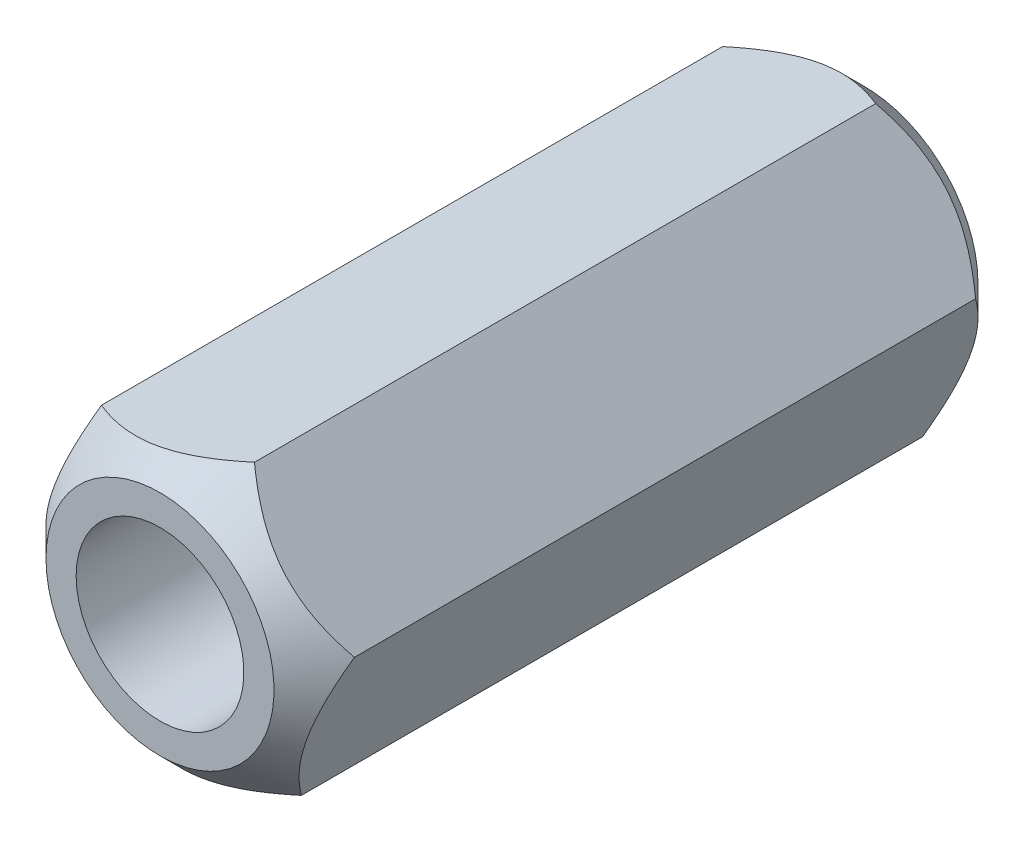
ISO-10303-21;
HEADER;
FILE_DESCRIPTION(('STEP AP214'),'2;1');
FILE_NAME('part.step','',(''),(''),'','','');
FILE_SCHEMA(('AUTOMOTIVE_DESIGN { 1 0 10303 214 1 1 1 1 }'));
ENDSEC;
DATA;
#1=APPLICATION_CONTEXT('core data for automotive mechanical design processes');
#2=APPLICATION_PROTOCOL_DEFINITION('international standard','automotive_design',2000,#1);
#3=PRODUCT_CONTEXT('',#1,'mechanical');
#4=PRODUCT('Part','Part','',(#3));
#5=PRODUCT_RELATED_PRODUCT_CATEGORY('part','',(#4));
#6=PRODUCT_DEFINITION_FORMATION('','',#4);
#7=PRODUCT_DEFINITION_CONTEXT('part definition',#1,'design');
#8=PRODUCT_DEFINITION('design','',#6,#7);
#9=PRODUCT_DEFINITION_SHAPE('','',#8);
#10=(LENGTH_UNIT() NAMED_UNIT(*) SI_UNIT(.MILLI.,.METRE.));
#11=(NAMED_UNIT(*) PLANE_ANGLE_UNIT() SI_UNIT($,.RADIAN.));
#12=(NAMED_UNIT(*) SI_UNIT($,.STERADIAN.) SOLID_ANGLE_UNIT());
#13=UNCERTAINTY_MEASURE_WITH_UNIT(LENGTH_MEASURE(1.E-05),#10,'distance_accuracy_value','');
#14=(GEOMETRIC_REPRESENTATION_CONTEXT(3) GLOBAL_UNCERTAINTY_ASSIGNED_CONTEXT((#13)) GLOBAL_UNIT_ASSIGNED_CONTEXT((#10,
#11,#12)) REPRESENTATION_CONTEXT('',''));
#15=CARTESIAN_POINT('',(0.,0.,0.));
#16=DIRECTION('',(0.,0.,1.));
#17=DIRECTION('',(1.,0.,0.));
#18=AXIS2_PLACEMENT_3D('',#15,#16,#17);
#19=CARTESIAN_POINT('',(23.598367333,209.806088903,-17.));
#20=DIRECTION('',(0.,0.,-1.));
#21=DIRECTION('',(-0.984657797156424,-0.174496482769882,0.));
#22=AXIS2_PLACEMENT_3D('',#19,#20,#21);
#23=PLANE('',#22);
#24=CARTESIAN_POINT('',(17.14,214.32,-17.));
#25=DIRECTION('',(0.,0.,-1.));
#26=DIRECTION('',(-1.,0.,0.));
#27=AXIS2_PLACEMENT_3D('',#24,#25,#26);
#28=CIRCLE('',#27,4.04999999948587);
#29=CARTESIAN_POINT('',(13.0900000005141,214.32,-17.));
#30=VERTEX_POINT('',#29);
#31=EDGE_CURVE('E205',#30,#30,#28,.T.);
#32=ORIENTED_EDGE('',*,*,#31,.F.);
#33=EDGE_LOOP('',(#32));
#34=FACE_BOUND('',#33,.T.);
#35=CARTESIAN_POINT('',(17.14,214.32,-16.9999999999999));
#36=DIRECTION('',(0.,0.,1.));
#37=DIRECTION('',(1.,0.,0.));
#38=AXIS2_PLACEMENT_3D('',#35,#36,#37);
#39=CIRCLE('',#38,5.50555349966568);
#40=CARTESIAN_POINT('',(22.6455534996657,214.32,-16.9999999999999));
#41=VERTEX_POINT('',#40);
#42=EDGE_CURVE('E16',#41,#41,#39,.F.);
#43=ORIENTED_EDGE('',*,*,#42,.T.);
#44=EDGE_LOOP('',(#43));
#45=FACE_BOUND('',#44,.T.);
#46=ADVANCED_FACE('F12',(#34,#45),#23,.T.);
#47=CARTESIAN_POINT('',(17.14,214.32,-17.));
#48=DIRECTION('',(0.,0.,1.));
#49=DIRECTION('',(1.,0.,0.));
#50=AXIS2_PLACEMENT_3D('',#47,#48,#49);
#51=CONICAL_SURFACE('',#50,5.50555349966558,0.785398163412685);
#52=CARTESIAN_POINT('',(19.7009737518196,221.375122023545,-15.0000000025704));
#53=CARTESIAN_POINT('',(19.7840077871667,221.276338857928,-15.0645131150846));
#54=CARTESIAN_POINT('',(19.8676800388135,221.176796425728,-15.1270462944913));
#55=CARTESIAN_POINT('',(20.0364261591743,220.976044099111,-15.2475505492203));
#56=CARTESIAN_POINT('',(20.1215007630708,220.87483333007,-15.3055191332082));
#57=CARTESIAN_POINT('',(20.3798060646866,220.567535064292,-15.4721688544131));
#58=CARTESIAN_POINT('',(20.5552232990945,220.358846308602,-15.5728831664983));
#59=CARTESIAN_POINT('',(20.9089660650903,219.938008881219,-15.7453489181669));
#60=CARTESIAN_POINT('',(21.0872012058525,219.725967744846,-15.8175348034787));
#61=CARTESIAN_POINT('',(21.3574838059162,219.404420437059,-15.9010357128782));
#62=CARTESIAN_POINT('',(21.4479758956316,219.296764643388,-15.9247285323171));
#63=CARTESIAN_POINT('',(21.6297261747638,219.080541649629,-15.9633187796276));
#64=CARTESIAN_POINT('',(21.7209842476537,218.971974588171,-15.9782175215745));
#65=CARTESIAN_POINT('',(21.943375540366,218.707402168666,-16.0031980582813));
#66=CARTESIAN_POINT('',(22.0747483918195,218.551111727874,-16.008438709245));
#67=CARTESIAN_POINT('',(22.3372572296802,218.23881263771,-15.9996376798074));
#68=CARTESIAN_POINT('',(22.4683931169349,218.082804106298,-15.9855892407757));
#69=CARTESIAN_POINT('',(22.729428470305,217.772257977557,-15.9390381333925));
#70=CARTESIAN_POINT('',(22.85932638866,217.617722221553,-15.9065148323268));
#71=CARTESIAN_POINT('',(23.116889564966,217.311306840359,-15.8247821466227));
#72=CARTESIAN_POINT('',(23.2445549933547,217.159427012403,-15.7755740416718));
#73=CARTESIAN_POINT('',(23.4711684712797,216.889831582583,-15.6743452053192));
#74=CARTESIAN_POINT('',(23.5706186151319,216.771518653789,-15.6249882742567));
#75=CARTESIAN_POINT('',(23.7677339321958,216.537016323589,-15.5183218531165));
#76=CARTESIAN_POINT('',(23.8653990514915,216.420826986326,-15.4610121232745));
#77=CARTESIAN_POINT('',(24.0586366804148,216.190937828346,-15.339724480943));
#78=CARTESIAN_POINT('',(24.1542146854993,216.077231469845,-15.275767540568));
#79=CARTESIAN_POINT('',(24.3436011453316,215.851923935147,-15.1420248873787));
#80=CARTESIAN_POINT('',(24.4374106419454,215.740321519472,-15.0722427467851));
#81=CARTESIAN_POINT('',(24.5304017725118,215.62969268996,-15.0000000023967));
#82=B_SPLINE_CURVE_WITH_KNOTS('',3,(#52,#53,#54,#55,#56,#57,#58,#59,#60,#61,#62,#63,#64,#65,#66,
#67,#68,#69,#70,#71,#72,#73,#74,#75,#76,#77,#78,#79,#80,#81),.UNSPECIFIED.,.F.,.F.,(4,2,2,2,2,2,
2,2,2,2,2,2,2,2,4),(0.,0.432793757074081,0.86582211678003,1.73655298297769,2.59345958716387,
3.02107268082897,3.44862186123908,4.0603826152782,4.67235777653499,5.28501773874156,
5.89763072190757,6.38414619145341,6.87067633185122,7.35571555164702,7.84045948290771),.UNSPECIFIED.);
#83=CARTESIAN_POINT('',(19.7009737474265,221.375122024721,-15.0000000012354));
#84=VERTEX_POINT('',#83);
#85=CARTESIAN_POINT('',(24.5304017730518,215.629692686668,-15.0000000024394));
#86=VERTEX_POINT('',#85);
#87=EDGE_CURVE('E58',#84,#86,#82,.T.);
#88=ORIENTED_EDGE('',*,*,#87,.T.);
#89=CARTESIAN_POINT('',(24.5304017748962,215.629692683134,-15.0000000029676));
#90=CARTESIAN_POINT('',(24.4863700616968,215.508391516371,-15.0645131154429));
#91=CARTESIAN_POINT('',(24.4419999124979,215.386158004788,-15.1270462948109));
#92=CARTESIAN_POINT('',(24.3525163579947,215.139643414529,-15.2475505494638));
#93=CARTESIAN_POINT('',(24.3074025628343,215.015361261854,-15.3055191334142));
#94=CARTESIAN_POINT('',(24.1704271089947,214.638013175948,-15.4721688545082));
#95=CARTESIAN_POINT('',(24.0774059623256,214.381753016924,-15.5728831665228));
#96=CARTESIAN_POINT('',(23.8898214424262,213.864984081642,-15.7453489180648));
#97=CARTESIAN_POINT('',(23.7953060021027,213.604607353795,-15.8175348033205));
#98=CARTESIAN_POINT('',(23.6519791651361,213.209762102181,-15.9010357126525));
#99=CARTESIAN_POINT('',(23.6039925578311,213.077565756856,-15.9247285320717));
#100=CARTESIAN_POINT('',(23.5076130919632,212.812053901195,-15.9633187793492));
#101=CARTESIAN_POINT('',(23.4592202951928,212.67873856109,-15.9782175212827));
#102=CARTESIAN_POINT('',(23.341289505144,212.353855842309,-16.0031980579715));
#103=CARTESIAN_POINT('',(23.2716244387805,212.16193839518,-16.0084387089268));
#104=CARTESIAN_POINT('',(23.1324199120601,211.77844952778,-15.9996376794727));
#105=CARTESIAN_POINT('',(23.0628805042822,211.586878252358,-15.9855892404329));
#106=CARTESIAN_POINT('',(22.9244573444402,211.20554194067,-15.9390381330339));
#107=CARTESIAN_POINT('',(22.8555744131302,211.015779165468,-15.9065148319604));
#108=CARTESIAN_POINT('',(22.7189924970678,210.639515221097,-15.8247821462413));
#109=CARTESIAN_POINT('',(22.6512934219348,210.453013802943,-15.7755740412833));
#110=CARTESIAN_POINT('',(22.5311236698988,210.121963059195,-15.6743452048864));
#111=CARTESIAN_POINT('',(22.4783867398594,209.976680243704,-15.6249882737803));
#112=CARTESIAN_POINT('',(22.3738594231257,209.68872220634,-15.5183218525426));
#113=CARTESIAN_POINT('',(22.3220690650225,209.546047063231,-15.4610121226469));
#114=CARTESIAN_POINT('',(22.2195980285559,209.263753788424,-15.3397244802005));
#115=CARTESIAN_POINT('',(22.1689144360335,209.124127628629,-15.2757675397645));
#116=CARTESIAN_POINT('',(22.0684856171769,208.847460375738,-15.1420248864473));
#117=CARTESIAN_POINT('',(22.0187398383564,208.710417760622,-15.0722427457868));
#118=CARTESIAN_POINT('',(21.9694280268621,208.574570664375,-15.0000000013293));
#119=B_SPLINE_CURVE_WITH_KNOTS('',3,(#89,#90,#91,#92,#93,#94,#95,#96,#97,#98,#99,#100,#101,#102,
#103,#104,#105,#106,#107,#108,#109,#110,#111,#112,#113,#114,#115,#116,#117,#118),.UNSPECIFIED.,
.F.,.F.,(4,2,2,2,2,2,2,2,2,2,2,2,2,2,4),(0.,0.432793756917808,0.865822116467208,
1.73655298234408,2.59345958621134,3.02107267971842,3.44862185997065,4.06038261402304,
4.67235777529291,5.28501773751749,5.89763072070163,6.38414619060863,6.87067633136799,
7.35571555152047,7.84045948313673),.UNSPECIFIED.);
#120=CARTESIAN_POINT('',(21.9694280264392,208.57457066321,-15.0000000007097));
#121=VERTEX_POINT('',#120);
#122=EDGE_CURVE('E61',#86,#121,#119,.T.);
#123=ORIENTED_EDGE('',*,*,#122,.T.);
#124=CARTESIAN_POINT('',(21.9694280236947,208.574570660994,-15.0000000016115));
#125=CARTESIAN_POINT('',(21.8423622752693,208.552052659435,-15.064513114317));
#126=CARTESIAN_POINT('',(21.7143198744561,208.529361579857,-15.1270462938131));
#127=CARTESIAN_POINT('',(21.4560901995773,208.483599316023,-15.2475505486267));
#128=CARTESIAN_POINT('',(21.3259018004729,208.460527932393,-15.3055191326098));
#129=CARTESIAN_POINT('',(20.9306210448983,208.390478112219,-15.4721688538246));
#130=CARTESIAN_POINT('',(20.6621826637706,208.342906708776,-15.5728831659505));
#131=CARTESIAN_POINT('',(20.1208553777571,208.246975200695,-15.7453489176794));
#132=CARTESIAN_POINT('',(19.8481047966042,208.198639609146,-15.8175348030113));
#133=CARTESIAN_POINT('',(19.4344953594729,208.125341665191,-15.9010357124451));
#134=CARTESIAN_POINT('',(19.2960166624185,208.100801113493,-15.924728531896));
#135=CARTESIAN_POINT('',(19.0178869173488,208.051512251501,-15.9633187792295));
#136=CARTESIAN_POINT('',(18.8782360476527,208.026763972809,-15.9782175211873));
#137=CARTESIAN_POINT('',(18.5379139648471,207.966453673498,-16.0031980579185));
#138=CARTESIAN_POINT('',(18.336876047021,207.930826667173,-16.0084387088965));
#139=CARTESIAN_POINT('',(17.9351626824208,207.859636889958,-15.9996376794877));
#140=CARTESIAN_POINT('',(17.7344873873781,207.824074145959,-15.9855892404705));
#141=CARTESIAN_POINT('',(17.3350288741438,207.753283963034,-15.9390381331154));
#142=CARTESIAN_POINT('',(17.1362480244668,207.718056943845,-15.9065148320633));
#143=CARTESIAN_POINT('',(16.7421029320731,207.64820838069,-15.8247821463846));
#144=CARTESIAN_POINT('',(16.5467384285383,207.613586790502,-15.7755740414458));
#145=CARTESIAN_POINT('',(16.1999551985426,207.552131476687,-15.6743452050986));
#146=CARTESIAN_POINT('',(16.0477681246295,207.525161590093,-15.6249882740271));
#147=CARTESIAN_POINT('',(15.7461254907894,207.471705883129,-15.518321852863));
#148=CARTESIAN_POINT('',(15.5966700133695,207.445220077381,-15.4610121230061));
#149=CARTESIAN_POINT('',(15.3009613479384,207.392815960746,-15.3397244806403));
#150=CARTESIAN_POINT('',(15.1546997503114,207.366896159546,-15.275767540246));
#151=CARTESIAN_POINT('',(14.8648844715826,207.315536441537,-15.1420248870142));
#152=CARTESIAN_POINT('',(14.7213291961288,207.290096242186,-15.0722427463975));
#153=CARTESIAN_POINT('',(14.5790262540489,207.26487797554,-15.0000000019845));
#154=B_SPLINE_CURVE_WITH_KNOTS('',3,(#124,#125,#126,#127,#128,#129,#130,#131,#132,#133,#134,
#135,#136,#137,#138,#139,#140,#141,#142,#143,#144,#145,#146,#147,#148,#149,#150,#151,#152,#153),
.UNSPECIFIED.,.F.,.F.,(4,2,2,2,2,2,2,2,2,2,2,2,2,2,4),(0.,0.432793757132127,0.865822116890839,
1.73655298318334,2.59345958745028,3.02107268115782,3.4486218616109,4.06038261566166,
4.67235777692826,5.28501773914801,5.89763072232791,6.38414619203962,6.87067633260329,
7.35571555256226,7.84045948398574),.UNSPECIFIED.);
#155=CARTESIAN_POINT('',(14.5790262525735,207.264877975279,-15.0000000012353));
#156=VERTEX_POINT('',#155);
#157=EDGE_CURVE('E138',#121,#156,#154,.T.);
#158=ORIENTED_EDGE('',*,*,#157,.T.);
#159=CARTESIAN_POINT('',(14.5790262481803,207.264877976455,-15.0000000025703));
#160=CARTESIAN_POINT('',(14.4959922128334,207.363661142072,-15.0645131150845));
#161=CARTESIAN_POINT('',(14.4123199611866,207.463203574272,-15.1270462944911));
#162=CARTESIAN_POINT('',(14.2435738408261,207.663955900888,-15.2475505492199));
#163=CARTESIAN_POINT('',(14.1584992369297,207.76516666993,-15.3055191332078));
#164=CARTESIAN_POINT('',(13.9001939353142,208.072464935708,-15.4721688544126));
#165=CARTESIAN_POINT('',(13.7247767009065,208.281153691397,-15.5728831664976));
#166=CARTESIAN_POINT('',(13.3710339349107,208.70199111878,-15.7453489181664));
#167=CARTESIAN_POINT('',(13.1927987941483,208.914032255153,-15.8175348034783));
#168=CARTESIAN_POINT('',(12.9225161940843,209.23557956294,-15.9010357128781));
#169=CARTESIAN_POINT('',(12.8320241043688,209.343235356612,-15.924728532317));
#170=CARTESIAN_POINT('',(12.6502738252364,209.559458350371,-15.9633187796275));
#171=CARTESIAN_POINT('',(12.5590157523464,209.668025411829,-15.9782175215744));
#172=CARTESIAN_POINT('',(12.3366244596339,209.932597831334,-16.0031980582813));
#173=CARTESIAN_POINT('',(12.2052516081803,210.088888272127,-16.0084387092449));
#174=CARTESIAN_POINT('',(11.9427427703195,210.40118736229,-15.9996376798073));
#175=CARTESIAN_POINT('',(11.8116068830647,210.557195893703,-15.9855892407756));
#176=CARTESIAN_POINT('',(11.5505715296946,210.867742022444,-15.9390381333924));
#177=CARTESIAN_POINT('',(11.4206736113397,211.022277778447,-15.9065148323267));
#178=CARTESIAN_POINT('',(11.1631104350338,211.328693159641,-15.8247821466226));
#179=CARTESIAN_POINT('',(11.0354450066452,211.480572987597,-15.7755740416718));
#180=CARTESIAN_POINT('',(10.8088315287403,211.750168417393,-15.674345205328));
#181=CARTESIAN_POINT('',(10.7093813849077,211.868481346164,-15.6249882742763));
#182=CARTESIAN_POINT('',(10.5122660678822,212.102983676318,-15.5183218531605));
#183=CARTESIAN_POINT('',(10.4146009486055,212.219173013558,-15.4610121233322));
#184=CARTESIAN_POINT('',(10.2213633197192,212.449062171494,-15.3397244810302));
#185=CARTESIAN_POINT('',(10.1257853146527,212.562768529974,-15.2757675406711));
#186=CARTESIAN_POINT('',(9.93639885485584,212.78807606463,-15.1420248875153));
#187=CARTESIAN_POINT('',(9.84258935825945,212.899678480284,-15.0722427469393));
#188=CARTESIAN_POINT('',(9.74959822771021,213.010307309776,-15.0000000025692));
#189=B_SPLINE_CURVE_WITH_KNOTS('',3,(#159,#160,#161,#162,#163,#164,#165,#166,#167,#168,#169,
#170,#171,#172,#173,#174,#175,#176,#177,#178,#179,#180,#181,#182,#183,#184,#185,#186,#187,#188),
.UNSPECIFIED.,.F.,.F.,(4,2,2,2,2,2,2,2,2,2,2,2,2,2,4),(0.,0.432793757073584,0.86582211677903,
1.73655298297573,2.59345958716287,3.02107268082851,3.44862186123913,4.06038261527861,
4.67235777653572,5.28501773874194,5.89763072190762,6.3841461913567,6.87067633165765,
7.35571555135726,7.84045948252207),.UNSPECIFIED.);
#190=CARTESIAN_POINT('',(9.74959822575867,213.010307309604,-15.0000000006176));
#191=VERTEX_POINT('',#190);
#192=EDGE_CURVE('E144',#156,#191,#189,.T.);
#193=ORIENTED_EDGE('',*,*,#192,.T.);
#194=CARTESIAN_POINT('',(9.74959822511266,213.010307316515,-15.0000000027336));
#195=CARTESIAN_POINT('',(9.79362993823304,213.131608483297,-15.0645131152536));
#196=CARTESIAN_POINT('',(9.83800008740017,213.253841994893,-15.1270462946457));
#197=CARTESIAN_POINT('',(9.92748364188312,213.500356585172,-15.2475505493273));
#198=CARTESIAN_POINT('',(9.97259743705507,213.624638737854,-15.3055191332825));
#199=CARTESIAN_POINT('',(10.1095728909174,214.001986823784,-15.4721688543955));
#200=CARTESIAN_POINT('',(10.2025940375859,214.258246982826,-15.5728831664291));
#201=CARTESIAN_POINT('',(10.390178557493,214.775015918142,-15.7453489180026));
#202=CARTESIAN_POINT('',(10.4846939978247,215.035392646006,-15.8175348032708));
#203=CARTESIAN_POINT('',(10.6280208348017,215.430237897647,-15.90103571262));
#204=CARTESIAN_POINT('',(10.6760074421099,215.562434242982,-15.9247285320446));
#205=CARTESIAN_POINT('',(10.7723869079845,215.827946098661,-15.9633187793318));
#206=CARTESIAN_POINT('',(10.8207797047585,215.961261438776,-15.9782175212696));
#207=CARTESIAN_POINT('',(10.9387104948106,216.286144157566,-16.003198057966));
#208=CARTESIAN_POINT('',(11.0083755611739,216.478061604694,-16.0084387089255));
#209=CARTESIAN_POINT('',(11.1475800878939,216.861550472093,-15.9996376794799));
#210=CARTESIAN_POINT('',(11.2171194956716,217.053121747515,-15.9855892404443));
#211=CARTESIAN_POINT('',(11.3555426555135,217.434458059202,-15.9390381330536));
#212=CARTESIAN_POINT('',(11.4244255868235,217.624220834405,-15.9065148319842));
#213=CARTESIAN_POINT('',(11.5610075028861,218.000484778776,-15.8247821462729));
#214=CARTESIAN_POINT('',(11.6287065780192,218.18698619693,-15.7755740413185));
#215=CARTESIAN_POINT('',(11.7488763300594,218.51803694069,-15.6743452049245));
#216=CARTESIAN_POINT('',(11.8016132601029,218.663319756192,-15.6249882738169));
#217=CARTESIAN_POINT('',(11.9061405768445,218.951277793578,-15.518321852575));
#218=CARTESIAN_POINT('',(11.9579309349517,219.093952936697,-15.4610121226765));
#219=CARTESIAN_POINT('',(12.0604019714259,219.376246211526,-15.3397244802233));
#220=CARTESIAN_POINT('',(12.111085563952,219.515872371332,-15.2757675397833));
#221=CARTESIAN_POINT('',(12.211514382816,219.792539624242,-15.1420248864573));
#222=CARTESIAN_POINT('',(12.2612601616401,219.929582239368,-15.0722427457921));
#223=CARTESIAN_POINT('',(12.3105719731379,220.065429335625,-15.0000000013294));
#224=B_SPLINE_CURVE_WITH_KNOTS('',3,(#194,#195,#196,#197,#198,#199,#200,#201,#202,#203,#204,
#205,#206,#207,#208,#209,#210,#211,#212,#213,#214,#215,#216,#217,#218,#219,#220,#221,#222,#223),
.UNSPECIFIED.,.F.,.F.,(4,2,2,2,2,2,2,2,2,2,2,2,2,2,4),(0.,0.432793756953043,0.865822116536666,
1.73655298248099,2.59345958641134,3.02107267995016,3.44862186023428,4.06038261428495,
4.67235777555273,5.28501773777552,5.89763072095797,6.38414619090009,6.87067633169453,
7.35571555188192,7.84045948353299),.UNSPECIFIED.);
#225=CARTESIAN_POINT('',(12.3105719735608,220.06542933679,-15.0000000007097));
#226=VERTEX_POINT('',#225);
#227=EDGE_CURVE('E157',#191,#226,#224,.T.);
#228=ORIENTED_EDGE('',*,*,#227,.T.);
#229=CARTESIAN_POINT('',(12.3105719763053,220.065429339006,-15.0000000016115));
#230=CARTESIAN_POINT('',(12.4376377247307,220.087947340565,-15.0645131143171));
#231=CARTESIAN_POINT('',(12.5656801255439,220.110638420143,-15.1270462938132));
#232=CARTESIAN_POINT('',(12.8239098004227,220.156400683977,-15.2475505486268));
#233=CARTESIAN_POINT('',(12.954098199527,220.179472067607,-15.3055191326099));
#234=CARTESIAN_POINT('',(13.3493789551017,220.249521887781,-15.4721688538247));
#235=CARTESIAN_POINT('',(13.6178173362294,220.297093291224,-15.5728831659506));
#236=CARTESIAN_POINT('',(14.1591446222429,220.393024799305,-15.7453489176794));
#237=CARTESIAN_POINT('',(14.4318952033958,220.441360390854,-15.8175348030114));
#238=CARTESIAN_POINT('',(14.8455046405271,220.514658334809,-15.9010357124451));
#239=CARTESIAN_POINT('',(14.9839833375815,220.539198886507,-15.9247285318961));
#240=CARTESIAN_POINT('',(15.2621130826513,220.588487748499,-15.9633187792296));
#241=CARTESIAN_POINT('',(15.4017639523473,220.613236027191,-15.9782175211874));
#242=CARTESIAN_POINT('',(15.742086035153,220.673546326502,-16.0031980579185));
#243=CARTESIAN_POINT('',(15.943123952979,220.709173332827,-16.0084387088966));
#244=CARTESIAN_POINT('',(16.3448373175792,220.780363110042,-15.9996376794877));
#245=CARTESIAN_POINT('',(16.5455126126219,220.815925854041,-15.9855892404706));
#246=CARTESIAN_POINT('',(16.9449711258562,220.886716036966,-15.9390381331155));
#247=CARTESIAN_POINT('',(17.1437519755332,220.921943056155,-15.9065148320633));
#248=CARTESIAN_POINT('',(17.5378970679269,220.99179161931,-15.8247821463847));
#249=CARTESIAN_POINT('',(17.7332615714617,221.026413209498,-15.7755740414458));
#250=CARTESIAN_POINT('',(18.0800448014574,221.087868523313,-15.6743452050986));
#251=CARTESIAN_POINT('',(18.2322318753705,221.114838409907,-15.6249882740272));
#252=CARTESIAN_POINT('',(18.5338745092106,221.168294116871,-15.518321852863));
#253=CARTESIAN_POINT('',(18.6833299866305,221.194779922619,-15.4610121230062));
#254=CARTESIAN_POINT('',(18.9790386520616,221.247184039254,-15.3397244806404));
#255=CARTESIAN_POINT('',(19.1253002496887,221.273103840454,-15.275767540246));
#256=CARTESIAN_POINT('',(19.4151155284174,221.324463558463,-15.1420248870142));
#257=CARTESIAN_POINT('',(19.5586708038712,221.349903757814,-15.0722427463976));
#258=CARTESIAN_POINT('',(19.7009737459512,221.37512202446,-15.0000000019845));
#259=B_SPLINE_CURVE_WITH_KNOTS('',3,(#229,#230,#231,#232,#233,#234,#235,#236,#237,#238,#239,
#240,#241,#242,#243,#244,#245,#246,#247,#248,#249,#250,#251,#252,#253,#254,#255,#256,#257,#258),
.UNSPECIFIED.,.F.,.F.,(4,2,2,2,2,2,2,2,2,2,2,2,2,2,4),(0.,0.432793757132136,0.86582211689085,
1.73655298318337,2.59345958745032,3.02107268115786,3.44862186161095,4.0603826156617,
4.67235777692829,5.28501773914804,5.89763072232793,6.38414619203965,6.87067633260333,
7.35571555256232,7.84045948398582),.UNSPECIFIED.);
#260=EDGE_CURVE('E64',#226,#84,#259,.T.);
#261=ORIENTED_EDGE('',*,*,#260,.T.);
#262=EDGE_LOOP('',(#88,#123,#158,#193,#228,#261));
#263=FACE_BOUND('',#262,.T.);
#264=ORIENTED_EDGE('',*,*,#42,.F.);
#265=EDGE_LOOP('',(#264));
#266=FACE_BOUND('',#265,.T.);
#267=ADVANCED_FACE('F59',(#263,#266),#51,.T.);
#268=CARTESIAN_POINT('',(24.530401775,215.629692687,-16.239643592));
#269=DIRECTION('',(-0.939986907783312,0.341210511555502,0.));
#270=DIRECTION('',(-0.341210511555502,-0.939986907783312,0.));
#271=AXIS2_PLACEMENT_3D('',#268,#269,#270);
#272=PLANE('',#271);
#273=DIRECTION('',(0.,0.,-1.));
#274=VECTOR('',#273,1.);
#275=CARTESIAN_POINT('',(21.969428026,208.574570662,0.));
#276=LINE('',#275,#274);
#277=CARTESIAN_POINT('',(21.9694280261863,208.574570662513,15.000000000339));
#278=VERTEX_POINT('',#277);
#279=EDGE_CURVE('E72',#278,#121,#276,.T.);
#280=ORIENTED_EDGE('',*,*,#279,.T.);
#281=ORIENTED_EDGE('',*,*,#122,.F.);
#282=DIRECTION('',(0.,0.,1.));
#283=VECTOR('',#282,1.);
#284=CARTESIAN_POINT('',(24.530401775,215.629692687,0.));
#285=LINE('',#284,#283);
#286=CARTESIAN_POINT('',(24.5304017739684,215.629692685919,15.0000000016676));
#287=VERTEX_POINT('',#286);
#288=EDGE_CURVE('E31',#86,#287,#285,.T.);
#289=ORIENTED_EDGE('',*,*,#288,.T.);
#290=CARTESIAN_POINT('',(24.5304017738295,215.629692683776,15.0000000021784));
#291=CARTESIAN_POINT('',(24.4863700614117,215.508391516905,15.0645131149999));
#292=CARTESIAN_POINT('',(24.4419999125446,215.386158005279,15.1270462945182));
#293=CARTESIAN_POINT('',(24.352516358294,215.139643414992,15.2475505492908));
#294=CARTESIAN_POINT('',(24.3074025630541,215.015361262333,15.3055191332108));
#295=CARTESIAN_POINT('',(24.1704271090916,214.638013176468,15.4721688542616));
#296=CARTESIAN_POINT('',(24.077405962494,214.381753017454,15.5728831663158));
#297=CARTESIAN_POINT('',(23.8898214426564,213.864984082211,15.7453489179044));
#298=CARTESIAN_POINT('',(23.7953060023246,213.604607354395,15.8175348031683));
#299=CARTESIAN_POINT('',(23.6519791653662,213.209762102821,15.9010357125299));
#300=CARTESIAN_POINT('',(23.603992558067,213.077565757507,15.9247285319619));
#301=CARTESIAN_POINT('',(23.5076130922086,212.81205390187,15.9633187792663));
#302=CARTESIAN_POINT('',(23.4592202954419,212.678738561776,15.978217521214));
#303=CARTESIAN_POINT('',(23.3412895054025,212.353855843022,16.0031980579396));
#304=CARTESIAN_POINT('',(23.2716244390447,212.161938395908,16.0084387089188));
#305=CARTESIAN_POINT('',(23.1324199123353,211.778449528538,15.9996376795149));
#306=CARTESIAN_POINT('',(23.0628805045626,211.58687825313,15.9855892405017));
#307=CARTESIAN_POINT('',(22.9244573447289,211.205541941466,15.9390381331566));
#308=CARTESIAN_POINT('',(22.8555744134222,211.015779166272,15.9065148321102));
#309=CARTESIAN_POINT('',(22.7189924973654,210.639515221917,15.8247821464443));
#310=CARTESIAN_POINT('',(22.6512934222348,210.45301380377,15.7755740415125));
#311=CARTESIAN_POINT('',(22.5311236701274,210.121963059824,15.6743452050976));
#312=CARTESIAN_POINT('',(22.4783867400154,209.976680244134,15.6249882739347));
#313=CARTESIAN_POINT('',(22.3738594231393,209.688722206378,15.5183218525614));
#314=CARTESIAN_POINT('',(22.3220690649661,209.546047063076,15.4610121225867));
#315=CARTESIAN_POINT('',(22.2195980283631,209.263753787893,15.3397244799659));
#316=CARTESIAN_POINT('',(22.1689144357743,209.124127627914,15.2757675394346));
#317=CARTESIAN_POINT('',(22.0684856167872,208.847460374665,15.1420248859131));
#318=CARTESIAN_POINT('',(22.0187398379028,208.710417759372,15.0722427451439));
#319=CARTESIAN_POINT('',(21.9694280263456,208.574570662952,15.0000000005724));
#320=B_SPLINE_CURVE_WITH_KNOTS('',3,(#290,#291,#292,#293,#294,#295,#296,#297,#298,#299,#300,
#301,#302,#303,#304,#305,#306,#307,#308,#309,#310,#311,#312,#313,#314,#315,#316,#317,#318,#319),
.UNSPECIFIED.,.F.,.F.,(4,2,2,2,2,2,2,2,2,2,2,2,2,2,4),(0.,0.432793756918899,0.865822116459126,
1.73655298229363,2.59345958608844,3.0210726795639,3.44862185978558,4.06038261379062,
4.67235777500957,5.2850177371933,5.89763072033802,6.38414619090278,6.87067633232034,
7.35571555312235,7.84045948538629),.UNSPECIFIED.);
#321=EDGE_CURVE('E77',#287,#278,#320,.T.);
#322=ORIENTED_EDGE('',*,*,#321,.T.);
#323=EDGE_LOOP('',(#280,#281,#289,#322));
#324=FACE_BOUND('',#323,.T.);
#325=ADVANCED_FACE('F70',(#324),#272,.F.);
#326=CARTESIAN_POINT('',(14.579026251,207.264877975,-16.202362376));
#327=DIRECTION('',(-0.174496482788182,0.98465779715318,0.));
#328=DIRECTION('',(0.,0.,1.));
#329=AXIS2_PLACEMENT_3D('',#326,#327,#328);
#330=PLANE('',#329);
#331=DIRECTION('',(0.,0.,-1.));
#332=VECTOR('',#331,1.);
#333=CARTESIAN_POINT('',(14.579026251,207.264877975,0.));
#334=LINE('',#333,#332);
#335=CARTESIAN_POINT('',(14.5790262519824,207.264877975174,15.0000000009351));
#336=VERTEX_POINT('',#335);
#337=EDGE_CURVE('E143',#336,#156,#334,.T.);
#338=ORIENTED_EDGE('',*,*,#337,.T.);
#339=ORIENTED_EDGE('',*,*,#157,.F.);
#340=ORIENTED_EDGE('',*,*,#279,.F.);
#341=CARTESIAN_POINT('',(21.9694280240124,208.574570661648,15.0000000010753));
#342=CARTESIAN_POINT('',(21.8423622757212,208.552052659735,15.0645131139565));
#343=CARTESIAN_POINT('',(21.7143198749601,208.529361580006,15.1270462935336));
#344=CARTESIAN_POINT('',(21.4560902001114,208.483599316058,15.2475505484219));
#345=CARTESIAN_POINT('',(21.3259018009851,208.460527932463,15.3055191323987));
#346=CARTESIAN_POINT('',(20.9306210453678,208.390478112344,15.4721688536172));
#347=CARTESIAN_POINT('',(20.6621826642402,208.342906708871,15.5728831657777));
#348=CARTESIAN_POINT('',(20.1208553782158,208.246975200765,15.7453489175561));
#349=CARTESIAN_POINT('',(19.8481047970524,208.198639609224,15.8175348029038));
#350=CARTESIAN_POINT('',(19.434495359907,208.125341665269,15.901035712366));
#351=CARTESIAN_POINT('',(19.2960166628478,208.100801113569,15.9247285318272));
#352=CARTESIAN_POINT('',(19.0178869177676,208.051512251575,15.9633187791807));
#353=CARTESIAN_POINT('',(18.8782360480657,208.026763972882,15.9782175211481));
#354=CARTESIAN_POINT('',(18.5379139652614,207.966453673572,16.0031980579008));
#355=CARTESIAN_POINT('',(18.3368760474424,207.930826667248,16.0084387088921));
#356=CARTESIAN_POINT('',(17.9351626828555,207.859636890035,15.9996376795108));
#357=CARTESIAN_POINT('',(17.734487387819,207.824074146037,15.985589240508));
#358=CARTESIAN_POINT('',(17.3350288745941,207.753283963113,15.9390381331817));
#359=CARTESIAN_POINT('',(17.1362480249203,207.718056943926,15.9065148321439));
#360=CARTESIAN_POINT('',(16.7421029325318,207.648208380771,15.8247821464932));
#361=CARTESIAN_POINT('',(16.546738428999,207.613586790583,15.7755740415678));
#362=CARTESIAN_POINT('',(16.1999551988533,207.552131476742,15.6743452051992));
#363=CARTESIAN_POINT('',(16.047768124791,207.525161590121,15.6249882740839));
#364=CARTESIAN_POINT('',(15.7461254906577,207.471705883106,15.5183218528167));
#365=CARTESIAN_POINT('',(15.5966700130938,207.445220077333,15.4610121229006));
#366=CARTESIAN_POINT('',(15.3009613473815,207.392815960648,15.3397244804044));
#367=CARTESIAN_POINT('',(15.1546997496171,207.366896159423,15.2757675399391));
#368=CARTESIAN_POINT('',(14.864884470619,207.315536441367,15.142024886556));
#369=CARTESIAN_POINT('',(14.7213291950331,207.290096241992,15.072242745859));
#370=CARTESIAN_POINT('',(14.5790262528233,207.264877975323,15.0000000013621));
#371=B_SPLINE_CURVE_WITH_KNOTS('',3,(#341,#342,#343,#344,#345,#346,#347,#348,#349,#350,#351,
#352,#353,#354,#355,#356,#357,#358,#359,#360,#361,#362,#363,#364,#365,#366,#367,#368,#369,#370),
.UNSPECIFIED.,.F.,.F.,(4,2,2,2,2,2,2,2,2,2,2,2,2,2,4),(0.,0.432793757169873,0.865822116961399,
1.73655298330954,2.59345958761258,3.02107268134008,3.44862186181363,4.06038261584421,
4.6723577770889,5.28501773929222,5.8976307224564,6.38414619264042,6.87067633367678,
7.35571555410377,7.84045948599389),.UNSPECIFIED.);
#372=EDGE_CURVE('E79',#278,#336,#371,.T.);
#373=ORIENTED_EDGE('',*,*,#372,.T.);
#374=EDGE_LOOP('',(#338,#339,#340,#373));
#375=FACE_BOUND('',#374,.T.);
#376=ADVANCED_FACE('F128',(#375),#330,.F.);
#377=CARTESIAN_POINT('',(14.579026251,207.264877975,-16.239643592));
#378=DIRECTION('',(0.76549042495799,0.643447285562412,0.));
#379=DIRECTION('',(-0.643447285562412,0.76549042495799,0.));
#380=AXIS2_PLACEMENT_3D('',#377,#378,#379);
#381=PLANE('',#380);
#382=DIRECTION('',(0.,0.,-1.));
#383=VECTOR('',#382,1.);
#384=CARTESIAN_POINT('',(9.749598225,213.010307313,0.));
#385=LINE('',#384,#383);
#386=CARTESIAN_POINT('',(9.74959822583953,213.010307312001,15.0000000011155));
#387=VERTEX_POINT('',#386);
#388=EDGE_CURVE('E198',#387,#191,#385,.T.);
#389=ORIENTED_EDGE('',*,*,#388,.T.);
#390=ORIENTED_EDGE('',*,*,#192,.F.);
#391=ORIENTED_EDGE('',*,*,#337,.F.);
#392=CARTESIAN_POINT('',(14.5790262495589,207.264877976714,15.0000000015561));
#393=CARTESIAN_POINT('',(14.4959922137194,207.363661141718,15.0645131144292));
#394=CARTESIAN_POINT('',(14.4123199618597,207.463203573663,15.1270462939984));
#395=CARTESIAN_POINT('',(14.2435738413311,207.663955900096,15.2475505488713));
#396=CARTESIAN_POINT('',(14.1584992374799,207.765166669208,15.3055191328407));
#397=CARTESIAN_POINT('',(13.9001939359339,208.072464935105,15.4721688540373));
#398=CARTESIAN_POINT('',(13.724776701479,208.281153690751,15.5728831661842));
#399=CARTESIAN_POINT('',(13.3710339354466,208.701991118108,15.7453489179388));
#400=CARTESIAN_POINT('',(13.1927987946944,208.914032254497,15.8175348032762));
#401=CARTESIAN_POINT('',(12.9225161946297,209.235579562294,15.9010357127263));
#402=CARTESIAN_POINT('',(12.8320241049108,209.343235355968,15.924728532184));
#403=CARTESIAN_POINT('',(12.6502738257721,209.559458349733,15.9633187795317));
#404=CARTESIAN_POINT('',(12.559015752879,209.668025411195,15.9782175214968));
#405=CARTESIAN_POINT('',(12.3366244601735,209.932597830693,16.0031980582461));
#406=CARTESIAN_POINT('',(12.2052516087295,210.088888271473,16.0084387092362));
#407=CARTESIAN_POINT('',(11.9427427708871,210.401187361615,15.9996376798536));
#408=CARTESIAN_POINT('',(11.811606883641,210.557195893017,15.9855892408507));
#409=CARTESIAN_POINT('',(11.5505715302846,210.867742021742,15.9390381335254));
#410=CARTESIAN_POINT('',(11.4206736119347,211.022277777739,15.9065148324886));
#411=CARTESIAN_POINT('',(11.1631104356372,211.328693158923,15.824782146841));
#412=CARTESIAN_POINT('',(11.035445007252,211.480572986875,15.7755740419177));
#413=CARTESIAN_POINT('',(10.8088315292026,211.750168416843,15.6743452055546));
#414=CARTESIAN_POINT('',(10.7093813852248,211.868481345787,15.6249882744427));
#415=CARTESIAN_POINT('',(10.5122660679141,212.10298367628,15.518321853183));
#416=CARTESIAN_POINT('',(10.4146009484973,212.219173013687,15.4610121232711));
#417=CARTESIAN_POINT('',(10.2213633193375,212.449062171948,15.339724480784));
#418=CARTESIAN_POINT('',(10.1257853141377,212.562768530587,15.2757675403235));
#419=CARTESIAN_POINT('',(9.93639885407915,212.788076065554,15.1420248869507));
#420=CARTESIAN_POINT('',(9.84258935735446,212.899678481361,15.0722427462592));
#421=CARTESIAN_POINT('',(9.74959822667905,213.010307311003,15.0000000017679));
#422=B_SPLINE_CURVE_WITH_KNOTS('',3,(#392,#393,#394,#395,#396,#397,#398,#399,#400,#401,#402,
#403,#404,#405,#406,#407,#408,#409,#410,#411,#412,#413,#414,#415,#416,#417,#418,#419,#420,#421),
.UNSPECIFIED.,.F.,.F.,(4,2,2,2,2,2,2,2,2,2,2,2,2,2,4),(0.,0.432793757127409,0.865822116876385,
1.73655298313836,2.59345958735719,3.02107268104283,3.4486218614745,4.06038261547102,
4.67235777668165,5.28501773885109,5.89763072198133,6.3841461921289,6.87067633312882,
7.35571555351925,7.84045948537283),.UNSPECIFIED.);
#423=EDGE_CURVE('E112',#336,#387,#422,.T.);
#424=ORIENTED_EDGE('',*,*,#423,.T.);
#425=EDGE_LOOP('',(#389,#390,#391,#424));
#426=FACE_BOUND('',#425,.T.);
#427=ADVANCED_FACE('F131',(#426),#381,.F.);
#428=CARTESIAN_POINT('',(17.14,214.32,17.));
#429=DIRECTION('',(0.,0.,-1.));
#430=DIRECTION('',(-1.,0.,0.));
#431=AXIS2_PLACEMENT_3D('',#428,#429,#430);
#432=CYLINDRICAL_SURFACE('',#431,4.04999999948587);
#433=ORIENTED_EDGE('',*,*,#31,.T.);
#434=EDGE_LOOP('',(#433));
#435=FACE_BOUND('',#434,.T.);
#436=CARTESIAN_POINT('',(17.14,214.32,17.));
#437=DIRECTION('',(0.,0.,-1.));
#438=DIRECTION('',(-1.,0.,0.));
#439=AXIS2_PLACEMENT_3D('',#436,#437,#438);
#440=CIRCLE('',#439,4.04999999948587);
#441=CARTESIAN_POINT('',(13.0900000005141,214.32,17.));
#442=VERTEX_POINT('',#441);
#443=EDGE_CURVE('E186',#442,#442,#440,.F.);
#444=ORIENTED_EDGE('',*,*,#443,.T.);
#445=EDGE_LOOP('',(#444));
#446=FACE_BOUND('',#445,.T.);
#447=ADVANCED_FACE('F104',(#435,#446),#432,.F.);
#448=CARTESIAN_POINT('',(9.749598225,213.010307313,-16.239643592));
#449=DIRECTION('',(0.939986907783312,-0.341210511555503,0.));
#450=DIRECTION('',(0.341210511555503,0.939986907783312,0.));
#451=AXIS2_PLACEMENT_3D('',#448,#449,#450);
#452=PLANE('',#451);
#453=DIRECTION('',(0.,0.,-1.));
#454=VECTOR('',#453,1.);
#455=CARTESIAN_POINT('',(12.310571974,220.065429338,0.));
#456=LINE('',#455,#454);
#457=CARTESIAN_POINT('',(12.3105719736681,220.065429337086,15.0000000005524));
#458=VERTEX_POINT('',#457);
#459=EDGE_CURVE('E83',#458,#226,#456,.T.);
#460=ORIENTED_EDGE('',*,*,#459,.T.);
#461=ORIENTED_EDGE('',*,*,#227,.F.);
#462=ORIENTED_EDGE('',*,*,#388,.F.);
#463=CARTESIAN_POINT('',(9.74959822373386,213.010307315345,15.00000000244));
#464=CARTESIAN_POINT('',(9.79362993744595,213.131608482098,15.0645131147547));
#465=CARTESIAN_POINT('',(9.83800008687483,213.253841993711,15.1270462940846));
#466=CARTESIAN_POINT('',(9.92748364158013,213.500356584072,15.2475505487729));
#467=CARTESIAN_POINT('',(9.97259743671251,213.624638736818,15.3055191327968));
#468=CARTESIAN_POINT('',(10.1095728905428,214.001986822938,15.4721688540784));
#469=CARTESIAN_POINT('',(10.2025940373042,214.258246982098,15.5728831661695));
#470=CARTESIAN_POINT('',(10.3901785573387,214.77501591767,15.7453489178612));
#471=CARTESIAN_POINT('',(10.4846939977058,215.03539264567,15.8175348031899));
#472=CARTESIAN_POINT('',(10.628020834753,215.430237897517,15.9010357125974));
#473=CARTESIAN_POINT('',(10.6760074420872,215.56243424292,15.924728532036));
#474=CARTESIAN_POINT('',(10.7723869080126,215.827946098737,15.9633187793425));
#475=CARTESIAN_POINT('',(10.8207797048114,215.961261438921,15.9782175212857));
#476=CARTESIAN_POINT('',(10.9387104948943,216.286144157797,16.0031980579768));
#477=CARTESIAN_POINT('',(11.0083755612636,216.478061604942,16.0084387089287));
#478=CARTESIAN_POINT('',(11.1475800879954,216.861550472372,15.9996376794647));
#479=CARTESIAN_POINT('',(11.2171194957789,217.053121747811,15.9855892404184));
#480=CARTESIAN_POINT('',(11.3555426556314,217.434458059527,15.9390381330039));
#481=CARTESIAN_POINT('',(11.4244255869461,217.624220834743,15.9065148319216));
#482=CARTESIAN_POINT('',(11.5610075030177,218.000484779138,15.8247821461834));
#483=CARTESIAN_POINT('',(11.628706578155,218.186986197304,15.775574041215));
#484=CARTESIAN_POINT('',(11.7488763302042,218.518036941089,15.6743452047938));
#485=CARTESIAN_POINT('',(11.8016132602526,218.663319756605,15.624988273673));
#486=CARTESIAN_POINT('',(11.9061405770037,218.951277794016,15.5183218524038));
#487=CARTESIAN_POINT('',(11.9579309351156,219.093952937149,15.4610121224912));
#488=CARTESIAN_POINT('',(12.0604019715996,219.376246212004,15.339724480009));
#489=CARTESIAN_POINT('',(12.1110855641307,219.515872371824,15.275767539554));
#490=CARTESIAN_POINT('',(12.2115143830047,219.792539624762,15.1420248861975));
#491=CARTESIAN_POINT('',(12.2612601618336,219.929582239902,15.0722427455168));
#492=CARTESIAN_POINT('',(12.3105719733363,220.065429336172,15.0000000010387));
#493=B_SPLINE_CURVE_WITH_KNOTS('',3,(#463,#464,#465,#466,#467,#468,#469,#470,#471,#472,#473,
#474,#475,#476,#477,#478,#479,#480,#481,#482,#483,#484,#485,#486,#487,#488,#489,#490,#491,#492),
.UNSPECIFIED.,.F.,.F.,(4,2,2,2,2,2,2,2,2,2,2,2,2,2,4),(0.,0.432793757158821,0.865822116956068,
1.73655298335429,2.59345958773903,3.02107268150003,3.44862186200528,4.06038261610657,
4.67235777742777,5.28501773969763,5.89763072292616,6.38414619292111,6.87067633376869,
7.35571555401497,7.84045948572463),.UNSPECIFIED.);
#494=EDGE_CURVE('E181',#387,#458,#493,.T.);
#495=ORIENTED_EDGE('',*,*,#494,.T.);
#496=EDGE_LOOP('',(#460,#461,#462,#495));
#497=FACE_BOUND('',#496,.T.);
#498=ADVANCED_FACE('F174',(#497),#452,.F.);
#499=CARTESIAN_POINT('',(12.310571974,220.065429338,16.202362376));
#500=DIRECTION('',(0.174496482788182,-0.98465779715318,0.));
#501=DIRECTION('',(0.,0.,-1.));
#502=AXIS2_PLACEMENT_3D('',#499,#500,#501);
#503=PLANE('',#502);
#504=DIRECTION('',(0.,0.,-1.));
#505=VECTOR('',#504,1.);
#506=CARTESIAN_POINT('',(19.700973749,221.375122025,0.));
#507=LINE('',#506,#505);
#508=CARTESIAN_POINT('',(19.7009737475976,221.375122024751,15.0000000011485));
#509=VERTEX_POINT('',#508);
#510=EDGE_CURVE('E68',#509,#84,#507,.T.);
#511=ORIENTED_EDGE('',*,*,#510,.T.);
#512=ORIENTED_EDGE('',*,*,#260,.F.);
#513=ORIENTED_EDGE('',*,*,#459,.F.);
#514=CARTESIAN_POINT('',(12.3105719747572,220.065429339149,15.0000000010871));
#515=CARTESIAN_POINT('',(12.4376377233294,220.087947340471,15.0645131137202));
#516=CARTESIAN_POINT('',(12.5656801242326,220.110638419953,15.1270462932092));
#517=CARTESIAN_POINT('',(12.8239097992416,220.156400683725,15.2475505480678));
#518=CARTESIAN_POINT('',(12.9540981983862,220.17947206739,15.305519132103));
#519=CARTESIAN_POINT('',(13.3493789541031,220.249521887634,15.4721688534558));
#520=CARTESIAN_POINT('',(13.6178173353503,220.297093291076,15.5728831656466));
#521=CARTESIAN_POINT('',(14.1591446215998,220.393024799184,15.745348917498));
#522=CARTESIAN_POINT('',(14.4318952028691,220.441360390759,15.8175348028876));
#523=CARTESIAN_POINT('',(14.8455046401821,220.514658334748,15.9010357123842));
#524=CARTESIAN_POINT('',(14.9839833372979,220.539198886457,15.9247285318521));
#525=CARTESIAN_POINT('',(15.262113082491,220.58848774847,15.9633187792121));
#526=CARTESIAN_POINT('',(15.4017639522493,220.613236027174,15.9782175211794));
#527=CARTESIAN_POINT('',(15.7420860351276,220.673546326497,16.0031980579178));
#528=CARTESIAN_POINT('',(15.9431239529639,220.709173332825,16.0084387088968));
#529=CARTESIAN_POINT('',(16.344837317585,220.780363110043,15.9996376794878));
#530=CARTESIAN_POINT('',(16.5455126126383,220.815925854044,15.9855892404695));
#531=CARTESIAN_POINT('',(16.9449711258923,220.886716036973,15.9390381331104));
#532=CARTESIAN_POINT('',(17.1437519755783,220.921943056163,15.9065148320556));
#533=CARTESIAN_POINT('',(17.5378970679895,220.991791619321,15.8247821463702));
#534=CARTESIAN_POINT('',(17.7332615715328,221.026413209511,15.7755740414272));
#535=CARTESIAN_POINT('',(18.080044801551,221.08786852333,15.6743452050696));
#536=CARTESIAN_POINT('',(18.232231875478,221.114838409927,15.6249882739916));
#537=CARTESIAN_POINT('',(18.5338745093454,221.168294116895,15.518321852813));
#538=CARTESIAN_POINT('',(18.6833299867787,221.194779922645,15.4610121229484));
#539=CARTESIAN_POINT('',(18.9790386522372,221.247184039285,15.3397244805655));
#540=CARTESIAN_POINT('',(19.1253002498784,221.273103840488,15.2757675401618));
#541=CARTESIAN_POINT('',(19.4151155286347,221.324463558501,15.1420248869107));
#542=CARTESIAN_POINT('',(19.558670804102,221.349903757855,15.072242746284));
#543=CARTESIAN_POINT('',(19.7009737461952,221.375122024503,15.0000000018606));
#544=B_SPLINE_CURVE_WITH_KNOTS('',3,(#514,#515,#516,#517,#518,#519,#520,#521,#522,#523,#524,
#525,#526,#527,#528,#529,#530,#531,#532,#533,#534,#535,#536,#537,#538,#539,#540,#541,#542,#543),
.UNSPECIFIED.,.F.,.F.,(4,2,2,2,2,2,2,2,2,2,2,2,2,2,4),(0.,0.432793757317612,0.865822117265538,
1.73655298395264,2.5934595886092,3.02107268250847,3.44862186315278,4.06038261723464,
4.67235777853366,5.28501774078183,5.89763072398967,6.3841461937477,6.87067633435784,
7.35571555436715,7.8404594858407),.UNSPECIFIED.);
#545=EDGE_CURVE('E91',#458,#509,#544,.T.);
#546=ORIENTED_EDGE('',*,*,#545,.T.);
#547=EDGE_LOOP('',(#511,#512,#513,#546));
#548=FACE_BOUND('',#547,.T.);
#549=ADVANCED_FACE('F171',(#548),#503,.F.);
#550=CARTESIAN_POINT('',(19.700973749,221.375122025,-16.239643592));
#551=DIRECTION('',(-0.765490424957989,-0.643447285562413,0.));
#552=DIRECTION('',(0.643447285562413,-0.765490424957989,0.));
#553=AXIS2_PLACEMENT_3D('',#550,#551,#552);
#554=PLANE('',#553);
#555=ORIENTED_EDGE('',*,*,#288,.F.);
#556=ORIENTED_EDGE('',*,*,#87,.F.);
#557=ORIENTED_EDGE('',*,*,#510,.F.);
#558=CARTESIAN_POINT('',(19.700973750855,221.37512202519,15.0000000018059));
#559=CARTESIAN_POINT('',(19.7840077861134,221.276338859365,15.064513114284));
#560=CARTESIAN_POINT('',(19.8676800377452,221.176796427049,15.1270462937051));
#561=CARTESIAN_POINT('',(20.0364261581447,220.976044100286,15.2475505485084));
#562=CARTESIAN_POINT('',(20.1215007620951,220.874833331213,15.3055191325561));
#563=CARTESIAN_POINT('',(20.3798060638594,220.567535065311,15.4721688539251));
#564=CARTESIAN_POINT('',(20.5552232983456,220.358846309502,15.5728831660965));
#565=CARTESIAN_POINT('',(20.9089660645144,219.938008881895,15.745348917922));
#566=CARTESIAN_POINT('',(21.0872012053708,219.725967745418,15.8175348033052));
#567=CARTESIAN_POINT('',(21.3574838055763,219.404420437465,15.9010357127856));
#568=CARTESIAN_POINT('',(21.4479758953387,219.296764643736,15.9247285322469));
#569=CARTESIAN_POINT('',(21.6297261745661,219.080541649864,15.9633187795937));
#570=CARTESIAN_POINT('',(21.7209842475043,218.971974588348,15.9782175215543));
#571=CARTESIAN_POINT('',(21.9433755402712,218.707402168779,16.0031980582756));
#572=CARTESIAN_POINT('',(22.0747483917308,218.551111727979,16.008438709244));
#573=CARTESIAN_POINT('',(22.3372572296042,218.2388126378,15.9996376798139));
#574=CARTESIAN_POINT('',(22.4683931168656,218.08280410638,15.9855892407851));
#575=CARTESIAN_POINT('',(22.7294284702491,217.772257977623,15.9390381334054));
#576=CARTESIAN_POINT('',(22.8593263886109,217.617722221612,15.9065148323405));
#577=CARTESIAN_POINT('',(23.1168895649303,217.311306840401,15.8247821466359));
#578=CARTESIAN_POINT('',(23.2445549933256,217.159427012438,15.7755740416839));
#579=CARTESIAN_POINT('',(23.4711684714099,216.889831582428,15.6743452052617));
#580=CARTESIAN_POINT('',(23.5706186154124,216.771518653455,15.6249882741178));
#581=CARTESIAN_POINT('',(23.7677339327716,216.537016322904,15.518321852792));
#582=CARTESIAN_POINT('',(23.8653990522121,216.420826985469,15.4610121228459));
#583=CARTESIAN_POINT('',(24.0586366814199,216.190937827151,15.3397244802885));
#584=CARTESIAN_POINT('',(24.1542146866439,216.077231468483,15.2757675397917));
#585=CARTESIAN_POINT('',(24.3436011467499,215.85192393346,15.1420248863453));
#586=CARTESIAN_POINT('',(24.4374106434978,215.740321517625,15.0722427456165));
#587=CARTESIAN_POINT('',(24.5304017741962,215.629692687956,15.0000000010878));
#588=B_SPLINE_CURVE_WITH_KNOTS('',3,(#558,#559,#560,#561,#562,#563,#564,#565,#566,#567,#568,
#569,#570,#571,#572,#573,#574,#575,#576,#577,#578,#579,#580,#581,#582,#583,#584,#585,#586,#587),
.UNSPECIFIED.,.F.,.F.,(4,2,2,2,2,2,2,2,2,2,2,2,2,2,4),(0.,0.432793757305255,0.865822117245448,
1.73655298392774,2.59345958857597,3.02107268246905,3.44862186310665,4.06038261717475,
4.67235777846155,5.28501774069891,5.8976307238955,6.38414619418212,6.87067633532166,
7.35571555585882,7.84045948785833),.UNSPECIFIED.);
#589=EDGE_CURVE('E22',#509,#287,#588,.T.);
#590=ORIENTED_EDGE('',*,*,#589,.T.);
#591=EDGE_LOOP('',(#555,#556,#557,#590));
#592=FACE_BOUND('',#591,.T.);
#593=ADVANCED_FACE('F74',(#592),#554,.F.);
#594=CARTESIAN_POINT('',(23.598367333,209.806088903,17.));
#595=DIRECTION('',(0.,0.,-1.));
#596=DIRECTION('',(-0.984657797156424,-0.174496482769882,0.));
#597=AXIS2_PLACEMENT_3D('',#594,#595,#596);
#598=PLANE('',#597);
#599=ORIENTED_EDGE('',*,*,#443,.F.);
#600=EDGE_LOOP('',(#599));
#601=FACE_BOUND('',#600,.T.);
#602=CARTESIAN_POINT('',(17.14,214.32,17.));
#603=DIRECTION('',(0.,0.,-1.));
#604=DIRECTION('',(-1.,0.,0.));
#605=AXIS2_PLACEMENT_3D('',#602,#603,#604);
#606=CIRCLE('',#605,5.50555349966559);
#607=CARTESIAN_POINT('',(11.6344465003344,214.32,17.));
#608=VERTEX_POINT('',#607);
#609=EDGE_CURVE('E9',#608,#608,#606,.F.);
#610=ORIENTED_EDGE('',*,*,#609,.T.);
#611=EDGE_LOOP('',(#610));
#612=FACE_BOUND('',#611,.T.);
#613=ADVANCED_FACE('F14',(#601,#612),#598,.F.);
#614=CARTESIAN_POINT('',(17.14,214.32,17.));
#615=DIRECTION('',(0.,0.,-1.));
#616=DIRECTION('',(-1.,0.,0.));
#617=AXIS2_PLACEMENT_3D('',#614,#615,#616);
#618=CONICAL_SURFACE('',#617,5.5055534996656,0.785398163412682);
#619=ORIENTED_EDGE('',*,*,#494,.F.);
#620=ORIENTED_EDGE('',*,*,#423,.F.);
#621=ORIENTED_EDGE('',*,*,#372,.F.);
#622=ORIENTED_EDGE('',*,*,#321,.F.);
#623=ORIENTED_EDGE('',*,*,#589,.F.);
#624=ORIENTED_EDGE('',*,*,#545,.F.);
#625=EDGE_LOOP('',(#619,#620,#621,#622,#623,#624));
#626=FACE_BOUND('',#625,.T.);
#627=ORIENTED_EDGE('',*,*,#609,.F.);
#628=EDGE_LOOP('',(#627));
#629=FACE_BOUND('',#628,.T.);
#630=ADVANCED_FACE('F98',(#626,#629),#618,.T.);
#631=CLOSED_SHELL('',(#46,#267,#325,#376,#427,#447,#498,#549,#593,#613,#630));
#632=MANIFOLD_SOLID_BREP('B1',#631);
#633=ADVANCED_BREP_SHAPE_REPRESENTATION('',(#18,#632),#14);
#634=SHAPE_DEFINITION_REPRESENTATION(#9,#633);
ENDSEC;
END-ISO-10303-21;
